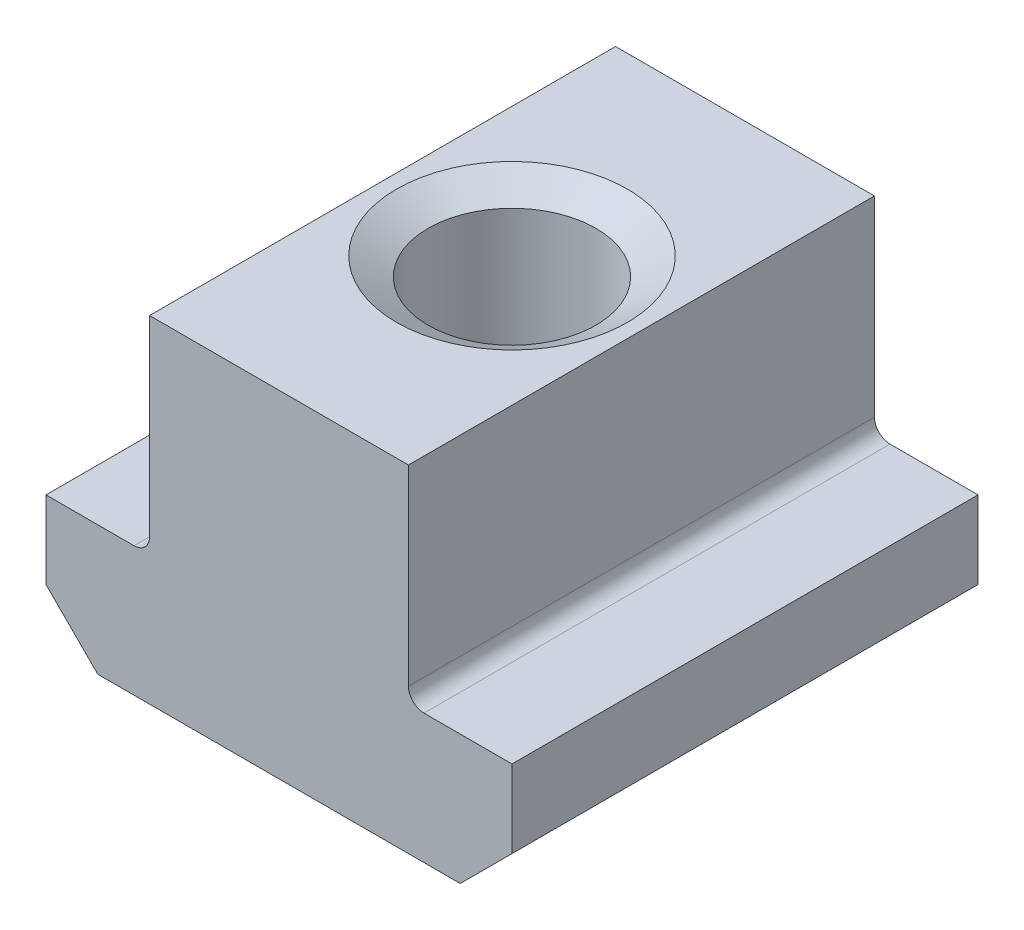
from build123d import *

# Parameters (mm, degrees)
BASENUT_DEPTH    = 9
CHAMFERS_SIZE    = 1
HOLESKE_R        = 1.621
TAPPEDHOLE_DEPTH = 12.979148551
CHAMFER1_SIZE    = 0.3516
CHAMFER1_SIZE2   = 0.608989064


with BuildPart() as part:
    # BaseNutSke → BaseNut (new body)
    with BuildSketch(Plane.XY):
        with BuildLine():
            Line((2.8, 2.5), (4.5, 2.5))
            Line((4.5, 2.5), (4.5, 0))
            Line((4.5, 0), (-4.5, 0))
            Line((-4.5, 0), (-4.5, 2.5))
            Line((-4.5, 2.5), (-2.8, 2.5))
            ThreePointArc((-2.8, 2.5), (-2.587867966, 2.587867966), (-2.5, 2.8))
            Line((-2.5, 2.8), (-2.5, 6.5))
            Line((-2.5, 6.5), (2.5, 6.5))
            Line((2.5, 6.5), (2.5, 2.8))
            ThreePointArc((2.5, 2.8), (2.587867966, 2.587867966), (2.8, 2.5))
        make_face()
    extrude(amount=-BASENUT_DEPTH)

    # Chamfers
    chamfers_edges = [part.edges().sort_by_distance(p)[0] for p in [
        (4.5, 0, -4.5),
        (-4.5, 0, -4.5),
    ]]
    chamfer(chamfers_edges, length=CHAMFERS_SIZE)

    # HoleSke → TappedHole (cut, through all)
    with BuildSketch(Plane(origin=(0, 6.5, 0), x_dir=(-1, 0, 0), z_dir=(0, 1, 0))):
        with Locations((0, -4.5)):
            Circle(HOLESKE_R)
    extrude(amount=-TAPPEDHOLE_DEPTH, mode=Mode.SUBTRACT)

    # Chamfer1
    chamfer1_edges = [part.edges().sort_by_distance(p)[0] for p in [
        (1.621, 0, -4.5),
        (1.621, 6.5, -4.5),
    ]]
    chamfer1_side = [part.faces().sort_by_distance(p)[0] for p in [
        (1.621, 3.25, -4.5),
    ]]
    chamfer(chamfer1_edges, length=CHAMFER1_SIZE, length2=CHAMFER1_SIZE2, reference=chamfer1_side[0])


solid = part.part
